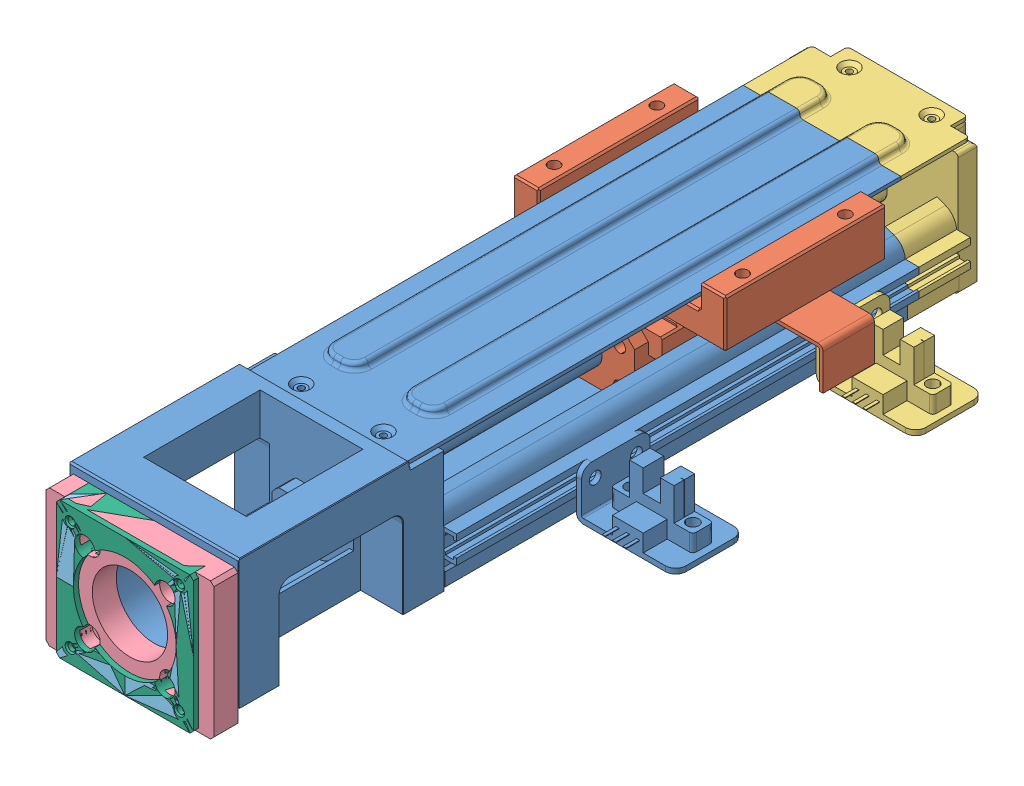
SolidWorks assembly FF50-B-0.SLDASM, configuration 150 (file format 9000). Lengths in mm.
Overall size (88.3 44 228.5).
6 component instances, 6 part files, 17 mates.
Components (placement in the parent):
- FF50-B-2-2: FF50-B-2.sldprt [150] at origin size (85.6 39 195)
- FF50-B-1-1: FF50-B-1.sldprt [默认] at (-9.0362 -1.0911 -77.7901)
- FF50-B-3-2: FF50-B-3.sldprt [默认] at origin
- 电机法兰（42系列步进电机）-1: 电机法兰（42系列步进电机）.SLDPRT [默认] at (-26.5362 7.7089 110) x (1 0 0) z (0 -1 0)
- 电机法兰（三菱30W-50W-100W）-1: 电机法兰（三菱30W-50W-100W）.SLDPRT [默认] at (-26.5362 7.7089 110) x (1 0 0) z (0 -1 0)
- 电机法兰（松下30W-50W-100W）-1: 电机法兰（松下30W-50W-100W）.SLDPRT [默认] at (-26.5362 7.7089 110) x (1 0 0) z (0 -1 0)
Mates (geometry in assembly coordinates):
- 同心1: concentric aligned: cylinder of FF50-B-2-2 through (-14.8689 19.3762 99.7234) axis (0 0 1) radius 1.25; cylinder of 电机法兰（42系列步进电机）-1 through (-14.8689 19.3762 113.5) axis (0 0 1) radius 3
- 同心2: concentric aligned: cylinder of FF50-B-2-2 through (-38.2035 19.3762 99.7234) axis (0 0 1) radius 1.25; cylinder of 电机法兰（42系列步进电机）-1 through (-38.2035 19.3762 110) axis (0 0 1) radius 1.75
- 重合1: coincident anti-aligned: plane of FF50-B-2-2 through (-26.5362 11.2089 110) normal (0 0 1); plane of 电机法兰（42系列步进电机）-1 through (-52.0162 -13.0911 110) normal (0 0 -1)
- 同心3: concentric aligned: cylinder of FF50-B-2-2 through (-38.2035 19.3762 99.7234) axis (0 0 1) radius 1.25; cylinder of 电机法兰（三菱30W-50W-100W）-1 through (-38.2035 19.3762 112) axis (0 0 1) radius 3
- 同心4: concentric aligned: cylinder of FF50-B-2-2 through (-14.8689 19.3762 99.7234) axis (0 0 1) radius 1.25; cylinder of 电机法兰（三菱30W-50W-100W）-1 through (-14.8689 19.3762 112) axis (0 0 1) radius 3
- 重合2: coincident anti-aligned: plane of FF50-B-2-2 through (-26.5362 11.2089 110) normal (0 0 1); plane of 电机法兰（三菱30W-50W-100W）-1 through (-47.3362 -13.0911 110) normal (0 0 -1)
- 同心5: concentric aligned: cylinder of FF50-B-2-2 through (-38.2035 19.3762 99.7234) axis (0 0 1) radius 1.25; cylinder of 电机法兰（松下30W-50W-100W）-1 through (-38.2035 19.3762 112) axis (0 0 1) radius 3
- 同心6: concentric aligned: cylinder of FF50-B-2-2 through (-14.8689 19.3762 99.7234) axis (0 0 1) radius 1.25; cylinder of 电机法兰（松下30W-50W-100W）-1 through (-14.8689 19.3762 112) axis (0 0 1) radius 3
- 重合3: coincident anti-aligned: plane of FF50-B-2-2 through (-26.5362 11.2089 110) normal (0 0 1); plane of 电机法兰（松下30W-50W-100W）-1 through (-47.3362 -13.0911 110) normal (0 0 -1)
- 重合4: coincident aligned: plane of FF50-B-2-2 through (-14.2362 -8.2911 -25) normal (0 -1 0); plane of FF50-B-3-2 through (-14.2362 -8.2911 -25) normal (0 -1 0)
- 重合5: coincident aligned: plane of FF50-B-2-2 through (-51.5362 -4.6911 -25) normal (-1 0 0); plane of FF50-B-3-2 through (-51.5362 -4.6911 -25) normal (-1 0 0)
- 重合6: coincident anti-aligned: plane of FF50-B-2-2 through (-45.8362 8.1697 -85) normal (0 0 -1); plane of FF50-B-3-2 through (1.7638 -274.5551 -85) normal (0 0 1)
- 距离1: distance = 40 mm anti-aligned: plane of FF50-B-1-1 through (0.7138 31.7089 -49.2901) normal (0 1 0); plane of FF50-B-2-2 through (-14.2362 -8.2911 -25) normal (0 -1 0)
- 距离2: distance = 6 mm aligned: plane of FF50-B-1-1 through (-57.5362 24.7089 -49.2901) normal (-1 0 0); plane of FF50-B-2-2 through (-51.5362 -4.6911 -25) normal (-1 0 0)
- 重合9: coincident anti-aligned: plane of FF50-B-2-2 through (-21.0362 29.7089 -85) normal (0 0 -1); plane of FF50-B-3-2 through (1.7638 -274.5551 -85) normal (0 0 1)
- LimitDistance1: limit distance = 59.7901 mm anti-aligned: plane of FF50-B-1-1 through (-26.5362 7.7089 -16.7901) normal (0 0 1); plane of FF50-B-2-2 through (-26.5362 7.7089 43) normal (0 0 -1)
- LimitDistance2: limit distance = 22.2099 mm anti-aligned: plane of FF50-B-1-1 through (-26.5362 8.0589 -77.7901) normal (0 0 -1); plane of FF50-B-3-2 through (-26.5362 11.9589 -100) normal (0 0 1)
